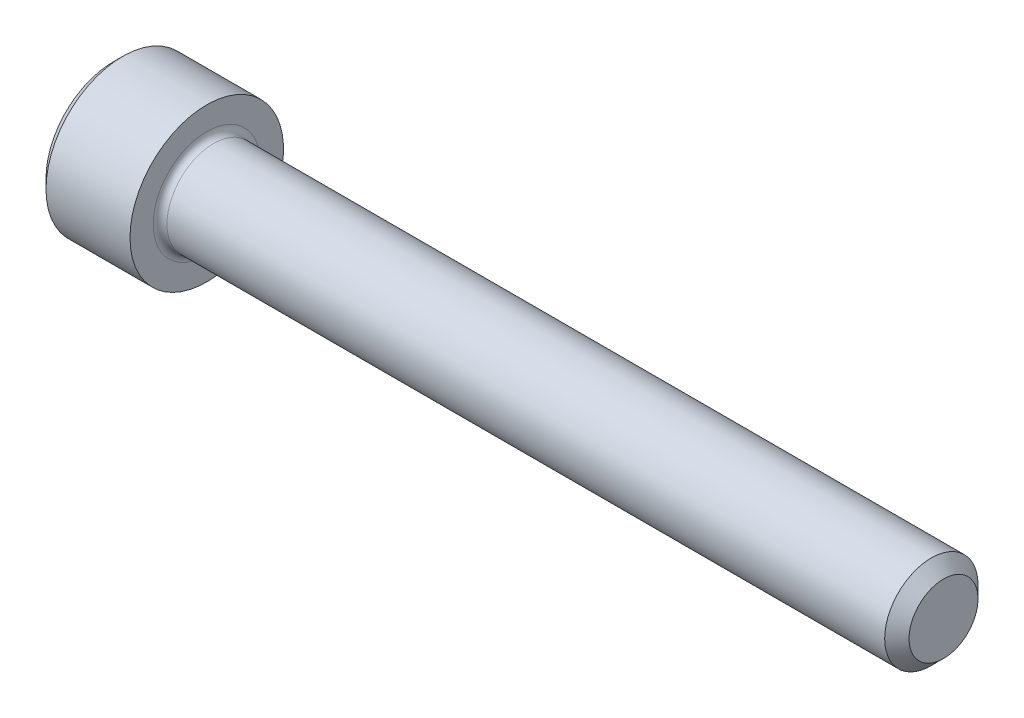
ISO-10303-21;
HEADER;
FILE_DESCRIPTION(('STEP AP214'),'2;1');
FILE_NAME('part.step','',(''),(''),'','','');
FILE_SCHEMA(('AUTOMOTIVE_DESIGN { 1 0 10303 214 1 1 1 1 }'));
ENDSEC;
DATA;
#1=APPLICATION_CONTEXT('core data for automotive mechanical design processes');
#2=APPLICATION_PROTOCOL_DEFINITION('international standard','automotive_design',2000,#1);
#3=PRODUCT_CONTEXT('',#1,'mechanical');
#4=PRODUCT('Part','Part','',(#3));
#5=PRODUCT_RELATED_PRODUCT_CATEGORY('part','',(#4));
#6=PRODUCT_DEFINITION_FORMATION('','',#4);
#7=PRODUCT_DEFINITION_CONTEXT('part definition',#1,'design');
#8=PRODUCT_DEFINITION('design','',#6,#7);
#9=PRODUCT_DEFINITION_SHAPE('','',#8);
#10=(LENGTH_UNIT() NAMED_UNIT(*) SI_UNIT(.MILLI.,.METRE.));
#11=(NAMED_UNIT(*) PLANE_ANGLE_UNIT() SI_UNIT($,.RADIAN.));
#12=(NAMED_UNIT(*) SI_UNIT($,.STERADIAN.) SOLID_ANGLE_UNIT());
#13=UNCERTAINTY_MEASURE_WITH_UNIT(LENGTH_MEASURE(1.E-05),#10,'distance_accuracy_value','');
#14=(GEOMETRIC_REPRESENTATION_CONTEXT(3) GLOBAL_UNCERTAINTY_ASSIGNED_CONTEXT((#13)) GLOBAL_UNIT_ASSIGNED_CONTEXT((#10,
#11,#12)) REPRESENTATION_CONTEXT('',''));
#15=CARTESIAN_POINT('',(0.,0.,0.));
#16=DIRECTION('',(0.,0.,1.));
#17=DIRECTION('',(1.,0.,0.));
#18=AXIS2_PLACEMENT_3D('',#15,#16,#17);
#19=CARTESIAN_POINT('',(0.,0.,0.));
#20=DIRECTION('',(-1.,0.,0.));
#21=DIRECTION('',(0.,0.,0.999999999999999));
#22=AXIS2_PLACEMENT_3D('',#19,#20,#21);
#23=PLANE('',#22);
#24=DIRECTION('',(0.,-0.499999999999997,0.866025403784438));
#25=VECTOR('',#24,1.);
#26=CARTESIAN_POINT('',(0.,2.2920921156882,0.));
#27=LINE('',#26,#25);
#28=CARTESIAN_POINT('',(0.,2.2920921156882,0.));
#29=VERTEX_POINT('',#28);
#30=CARTESIAN_POINT('',(-6.10622663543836E-13,1.14604605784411,1.98500999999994));
#31=VERTEX_POINT('',#30);
#32=EDGE_CURVE('E261',#29,#31,#27,.T.);
#33=ORIENTED_EDGE('',*,*,#32,.T.);
#34=DIRECTION('',(0.,0.999999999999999,0.));
#35=VECTOR('',#34,1.);
#36=CARTESIAN_POINT('',(-6.10622663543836E-13,-1.14604605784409,1.98500999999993));
#37=LINE('',#36,#35);
#38=CARTESIAN_POINT('',(-6.10622663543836E-13,-1.14604605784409,1.98500999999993));
#39=VERTEX_POINT('',#38);
#40=EDGE_CURVE('E132',#39,#31,#37,.T.);
#41=ORIENTED_EDGE('',*,*,#40,.F.);
#42=DIRECTION('',(0.,-0.5,-0.866025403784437));
#43=VECTOR('',#42,1.);
#44=CARTESIAN_POINT('',(-6.10622663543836E-13,-1.14604605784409,1.98500999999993));
#45=LINE('',#44,#43);
#46=CARTESIAN_POINT('',(0.,-2.29209211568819,0.));
#47=VERTEX_POINT('',#46);
#48=EDGE_CURVE('E264',#39,#47,#45,.T.);
#49=ORIENTED_EDGE('',*,*,#48,.T.);
#50=DIRECTION('',(0.,0.499999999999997,-0.86602540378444));
#51=VECTOR('',#50,1.);
#52=CARTESIAN_POINT('',(0.,-2.29209211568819,0.));
#53=LINE('',#52,#51);
#54=CARTESIAN_POINT('',(1.38777878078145E-13,-1.14604605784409,-1.98501000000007));
#55=VERTEX_POINT('',#54);
#56=EDGE_CURVE('E267',#47,#55,#53,.T.);
#57=ORIENTED_EDGE('',*,*,#56,.T.);
#58=DIRECTION('',(0.,-0.999999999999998,0.));
#59=VECTOR('',#58,1.);
#60=CARTESIAN_POINT('',(2.4980018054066E-13,1.1460460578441,-1.98501000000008));
#61=LINE('',#60,#59);
#62=CARTESIAN_POINT('',(2.4980018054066E-13,1.1460460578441,-1.98501000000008));
#63=VERTEX_POINT('',#62);
#64=EDGE_CURVE('E270',#63,#55,#61,.T.);
#65=ORIENTED_EDGE('',*,*,#64,.F.);
#66=DIRECTION('',(0.,-0.5,-0.866025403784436));
#67=VECTOR('',#66,1.);
#68=CARTESIAN_POINT('',(0.,2.2920921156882,0.));
#69=LINE('',#68,#67);
#70=EDGE_CURVE('E127',#29,#63,#69,.T.);
#71=ORIENTED_EDGE('',*,*,#70,.F.);
#72=EDGE_LOOP('',(#33,#41,#49,#57,#65,#71));
#73=FACE_BOUND('',#72,.T.);
#74=CARTESIAN_POINT('',(0.,0.,0.));
#75=DIRECTION('',(-1.,0.,0.));
#76=DIRECTION('',(0.,0.,0.999999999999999));
#77=AXIS2_PLACEMENT_3D('',#74,#75,#76);
#78=CIRCLE('',#77,3.48615);
#79=CARTESIAN_POINT('',(0.,0.,3.48615));
#80=VERTEX_POINT('',#79);
#81=EDGE_CURVE('E156',#80,#80,#78,.T.);
#82=ORIENTED_EDGE('',*,*,#81,.T.);
#83=EDGE_LOOP('',(#82));
#84=FACE_BOUND('',#83,.T.);
#85=ADVANCED_FACE('F36',(#73,#84),#23,.T.);
#86=CARTESIAN_POINT('',(0.,0.,0.));
#87=DIRECTION('',(1.,0.,0.));
#88=DIRECTION('',(0.,0.,-0.999999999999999));
#89=AXIS2_PLACEMENT_3D('',#86,#87,#88);
#90=CONICAL_SURFACE('',#89,3.48615,0.785398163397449);
#91=CARTESIAN_POINT('',(0.4826,0.,0.));
#92=DIRECTION('',(-1.,0.,0.));
#93=DIRECTION('',(0.,0.,0.999999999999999));
#94=AXIS2_PLACEMENT_3D('',#91,#92,#93);
#95=CIRCLE('',#94,3.96875);
#96=CARTESIAN_POINT('',(0.482599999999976,0.,3.96875));
#97=VERTEX_POINT('',#96);
#98=EDGE_CURVE('E153',#97,#97,#95,.T.);
#99=ORIENTED_EDGE('',*,*,#98,.T.);
#100=EDGE_LOOP('',(#99));
#101=FACE_BOUND('',#100,.T.);
#102=ORIENTED_EDGE('',*,*,#81,.F.);
#103=EDGE_LOOP('',(#102));
#104=FACE_BOUND('',#103,.T.);
#105=ADVANCED_FACE('F177',(#101,#104),#90,.T.);
#106=CARTESIAN_POINT('',(-31.75,0.,1.80411241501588E-13));
#107=DIRECTION('',(-1.,0.,0.));
#108=DIRECTION('',(0.,0.,0.999999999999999));
#109=AXIS2_PLACEMENT_3D('',#106,#107,#108);
#110=CYLINDRICAL_SURFACE('',#109,3.96875);
#111=CARTESIAN_POINT('',(4.826,0.,-1.07552855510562E-13));
#112=DIRECTION('',(-1.,0.,0.));
#113=DIRECTION('',(0.,0.,0.999999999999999));
#114=AXIS2_PLACEMENT_3D('',#111,#112,#113);
#115=CIRCLE('',#114,3.96875);
#116=CARTESIAN_POINT('',(4.82599999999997,0.,3.96874999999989));
#117=VERTEX_POINT('',#116);
#118=EDGE_CURVE('E150',#117,#117,#115,.T.);
#119=ORIENTED_EDGE('',*,*,#118,.T.);
#120=EDGE_LOOP('',(#119));
#121=FACE_BOUND('',#120,.T.);
#122=ORIENTED_EDGE('',*,*,#98,.F.);
#123=EDGE_LOOP('',(#122));
#124=FACE_BOUND('',#123,.T.);
#125=ADVANCED_FACE('F182',(#121,#124),#110,.T.);
#126=CARTESIAN_POINT('',(4.826,3.96874999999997,0.));
#127=DIRECTION('',(1.,0.,0.));
#128=DIRECTION('',(0.,0.,-0.999999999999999));
#129=AXIS2_PLACEMENT_3D('',#126,#127,#128);
#130=PLANE('',#129);
#131=CARTESIAN_POINT('',(4.826,0.,-1.07552855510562E-13));
#132=DIRECTION('',(1.,0.,0.));
#133=DIRECTION('',(0.,0.,-0.999999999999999));
#134=AXIS2_PLACEMENT_3D('',#131,#132,#133);
#135=CIRCLE('',#134,2.76859999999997);
#136=CARTESIAN_POINT('',(4.82600000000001,0.,-2.76860000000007));
#137=VERTEX_POINT('',#136);
#138=EDGE_CURVE('E44',#137,#137,#135,.F.);
#139=ORIENTED_EDGE('',*,*,#138,.T.);
#140=EDGE_LOOP('',(#139));
#141=FACE_BOUND('',#140,.T.);
#142=ORIENTED_EDGE('',*,*,#118,.F.);
#143=EDGE_LOOP('',(#142));
#144=FACE_BOUND('',#143,.T.);
#145=ADVANCED_FACE('F161',(#141,#144),#130,.T.);
#146=CARTESIAN_POINT('',(-31.75,0.,1.80411241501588E-13));
#147=DIRECTION('',(-1.,0.,0.));
#148=DIRECTION('',(0.,0.,0.999999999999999));
#149=AXIS2_PLACEMENT_3D('',#146,#147,#148);
#150=CYLINDRICAL_SURFACE('',#149,2.41299999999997);
#151=CARTESIAN_POINT('',(5.18160000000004,0.,-1.07552855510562E-13));
#152=DIRECTION('',(1.,0.,0.));
#153=DIRECTION('',(0.,0.,-0.999999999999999));
#154=AXIS2_PLACEMENT_3D('',#151,#152,#153);
#155=CIRCLE('',#154,2.41299999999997);
#156=CARTESIAN_POINT('',(5.18160000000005,0.,-2.41300000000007));
#157=VERTEX_POINT('',#156);
#158=EDGE_CURVE('E11',#157,#157,#155,.T.);
#159=ORIENTED_EDGE('',*,*,#158,.T.);
#160=EDGE_LOOP('',(#159));
#161=FACE_BOUND('',#160,.T.);
#162=CARTESIAN_POINT('',(42.2960799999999,0.,-3.12250225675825E-13));
#163=DIRECTION('',(-1.,0.,0.));
#164=DIRECTION('',(0.,0.,0.999999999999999));
#165=AXIS2_PLACEMENT_3D('',#162,#163,#164);
#166=CIRCLE('',#165,2.41299999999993);
#167=CARTESIAN_POINT('',(42.2960799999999,0.,2.41299999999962));
#168=VERTEX_POINT('',#167);
#169=EDGE_CURVE('E147',#168,#168,#166,.T.);
#170=ORIENTED_EDGE('',*,*,#169,.T.);
#171=EDGE_LOOP('',(#170));
#172=FACE_BOUND('',#171,.T.);
#173=ADVANCED_FACE('F192',(#161,#172),#150,.T.);
#174=CARTESIAN_POINT('',(42.926,0.,-4.16333634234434E-13));
#175=DIRECTION('',(-1.,0.,0.));
#176=DIRECTION('',(0.,0.,0.999999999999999));
#177=AXIS2_PLACEMENT_3D('',#174,#175,#176);
#178=CONICAL_SURFACE('',#177,1.78308,0.785398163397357);
#179=ORIENTED_EDGE('',*,*,#169,.F.);
#180=EDGE_LOOP('',(#179));
#181=FACE_BOUND('',#180,.T.);
#182=CARTESIAN_POINT('',(42.926,0.,-4.16333634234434E-13));
#183=DIRECTION('',(-1.,0.,0.));
#184=DIRECTION('',(0.,0.,0.999999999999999));
#185=AXIS2_PLACEMENT_3D('',#182,#183,#184);
#186=CIRCLE('',#185,1.78308);
#187=CARTESIAN_POINT('',(42.926,0.,1.78307999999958));
#188=VERTEX_POINT('',#187);
#189=EDGE_CURVE('E143',#188,#188,#186,.T.);
#190=ORIENTED_EDGE('',*,*,#189,.T.);
#191=EDGE_LOOP('',(#190));
#192=FACE_BOUND('',#191,.T.);
#193=ADVANCED_FACE('F172',(#181,#192),#178,.T.);
#194=CARTESIAN_POINT('',(42.926,1.78308,-4.09394740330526E-13));
#195=DIRECTION('',(1.,0.,0.));
#196=DIRECTION('',(0.,0.,-0.999999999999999));
#197=AXIS2_PLACEMENT_3D('',#194,#195,#196);
#198=PLANE('',#197);
#199=ORIENTED_EDGE('',*,*,#189,.F.);
#200=EDGE_LOOP('',(#199));
#201=FACE_BOUND('',#200,.T.);
#202=ADVANCED_FACE('F165',(#201),#198,.T.);
#203=CARTESIAN_POINT('',(5.18160000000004,0.,-1.07552855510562E-13));
#204=DIRECTION('',(1.,0.,0.));
#205=DIRECTION('',(0.,0.,-0.999999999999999));
#206=AXIS2_PLACEMENT_3D('',#203,#204,#205);
#207=TOROIDAL_SURFACE('',#206,2.76859999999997,0.3556);
#208=ORIENTED_EDGE('',*,*,#158,.F.);
#209=EDGE_LOOP('',(#208));
#210=FACE_BOUND('',#209,.T.);
#211=ORIENTED_EDGE('',*,*,#138,.F.);
#212=EDGE_LOOP('',(#211));
#213=FACE_BOUND('',#212,.T.);
#214=ADVANCED_FACE('F38',(#210,#213),#207,.F.);
#215=CARTESIAN_POINT('',(2.28600000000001,2.2920921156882,-1.94289029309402E-13));
#216=DIRECTION('',(0.,-0.866025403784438,-0.499999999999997));
#217=DIRECTION('',(0.,0.499999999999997,-0.866025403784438));
#218=AXIS2_PLACEMENT_3D('',#215,#216,#217);
#219=PLANE('',#218);
#220=ORIENTED_EDGE('',*,*,#32,.F.);
#221=DIRECTION('',(-1.,0.,0.));
#222=VECTOR('',#221,1.);
#223=CARTESIAN_POINT('',(2.28600000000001,2.2920921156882,-1.94289029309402E-13));
#224=LINE('',#223,#222);
#225=CARTESIAN_POINT('',(2.28600000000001,2.2920921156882,-1.94289029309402E-13));
#226=VERTEX_POINT('',#225);
#227=EDGE_CURVE('E251',#226,#29,#224,.T.);
#228=ORIENTED_EDGE('',*,*,#227,.F.);
#229=DIRECTION('',(0.,-0.499999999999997,0.866025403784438));
#230=VECTOR('',#229,1.);
#231=CARTESIAN_POINT('',(2.28600000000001,2.2920921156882,-1.94289029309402E-13));
#232=LINE('',#231,#230);
#233=CARTESIAN_POINT('',(2.2859999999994,1.71906908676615,0.992504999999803));
#234=VERTEX_POINT('',#233);
#235=EDGE_CURVE('E119',#226,#234,#232,.T.);
#236=ORIENTED_EDGE('',*,*,#235,.T.);
#237=CARTESIAN_POINT('',(2.28599999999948,1.14604605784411,1.98500999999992));
#238=VERTEX_POINT('',#237);
#239=EDGE_CURVE('E110',#234,#238,#232,.T.);
#240=ORIENTED_EDGE('',*,*,#239,.T.);
#241=DIRECTION('',(-1.,0.,0.));
#242=VECTOR('',#241,1.);
#243=CARTESIAN_POINT('',(2.28599999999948,1.14604605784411,1.98500999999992));
#244=LINE('',#243,#242);
#245=EDGE_CURVE('E124',#238,#31,#244,.T.);
#246=ORIENTED_EDGE('',*,*,#245,.T.);
#247=EDGE_LOOP('',(#220,#228,#236,#240,#246));
#248=FACE_BOUND('',#247,.T.);
#249=ADVANCED_FACE('F123',(#248),#219,.T.);
#250=CARTESIAN_POINT('',(2.28599999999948,-1.14604605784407,1.98500999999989));
#251=DIRECTION('',(0.,0.,0.999999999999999));
#252=DIRECTION('',(0.,-0.999999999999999,0.));
#253=AXIS2_PLACEMENT_3D('',#250,#251,#252);
#254=PLANE('',#253);
#255=ORIENTED_EDGE('',*,*,#40,.T.);
#256=ORIENTED_EDGE('',*,*,#245,.F.);
#257=DIRECTION('',(0.,0.999999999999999,0.));
#258=VECTOR('',#257,1.);
#259=CARTESIAN_POINT('',(2.28599999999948,-1.14604605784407,1.98500999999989));
#260=LINE('',#259,#258);
#261=CARTESIAN_POINT('',(2.28599999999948,0.,1.98500999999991));
#262=VERTEX_POINT('',#261);
#263=EDGE_CURVE('E107',#262,#238,#260,.T.);
#264=ORIENTED_EDGE('',*,*,#263,.F.);
#265=CARTESIAN_POINT('',(2.28599999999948,-1.14604605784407,1.98500999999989));
#266=VERTEX_POINT('',#265);
#267=EDGE_CURVE('E118',#266,#262,#260,.T.);
#268=ORIENTED_EDGE('',*,*,#267,.F.);
#269=DIRECTION('',(-1.,0.,0.));
#270=VECTOR('',#269,1.);
#271=CARTESIAN_POINT('',(2.28599999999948,-1.14604605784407,1.98500999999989));
#272=LINE('',#271,#270);
#273=EDGE_CURVE('E134',#266,#39,#272,.T.);
#274=ORIENTED_EDGE('',*,*,#273,.T.);
#275=EDGE_LOOP('',(#255,#256,#264,#268,#274));
#276=FACE_BOUND('',#275,.T.);
#277=ADVANCED_FACE('F129',(#276),#254,.F.);
#278=CARTESIAN_POINT('',(2.28599999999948,-1.14604605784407,1.98500999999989));
#279=DIRECTION('',(0.,0.866025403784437,-0.5));
#280=DIRECTION('',(0.,0.5,0.866025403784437));
#281=AXIS2_PLACEMENT_3D('',#278,#279,#280);
#282=PLANE('',#281);
#283=ORIENTED_EDGE('',*,*,#48,.F.);
#284=ORIENTED_EDGE('',*,*,#273,.F.);
#285=DIRECTION('',(0.,-0.5,-0.866025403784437));
#286=VECTOR('',#285,1.);
#287=CARTESIAN_POINT('',(2.28599999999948,-1.14604605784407,1.98500999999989));
#288=LINE('',#287,#286);
#289=CARTESIAN_POINT('',(2.2859999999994,-1.71906908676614,0.992504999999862));
#290=VERTEX_POINT('',#289);
#291=EDGE_CURVE('E290',#266,#290,#288,.T.);
#292=ORIENTED_EDGE('',*,*,#291,.T.);
#293=CARTESIAN_POINT('',(2.28600000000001,-2.29209211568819,0.));
#294=VERTEX_POINT('',#293);
#295=EDGE_CURVE('E279',#290,#294,#288,.T.);
#296=ORIENTED_EDGE('',*,*,#295,.T.);
#297=DIRECTION('',(-1.,0.,0.));
#298=VECTOR('',#297,1.);
#299=CARTESIAN_POINT('',(2.28600000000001,-2.29209211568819,0.));
#300=LINE('',#299,#298);
#301=EDGE_CURVE('E139',#294,#47,#300,.T.);
#302=ORIENTED_EDGE('',*,*,#301,.T.);
#303=EDGE_LOOP('',(#283,#284,#292,#296,#302));
#304=FACE_BOUND('',#303,.T.);
#305=ADVANCED_FACE('F205',(#304),#282,.T.);
#306=CARTESIAN_POINT('',(2.28600000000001,-2.29209211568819,0.));
#307=DIRECTION('',(0.,0.86602540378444,0.499999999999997));
#308=DIRECTION('',(0.,-0.499999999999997,0.86602540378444));
#309=AXIS2_PLACEMENT_3D('',#306,#307,#308);
#310=PLANE('',#309);
#311=ORIENTED_EDGE('',*,*,#56,.F.);
#312=ORIENTED_EDGE('',*,*,#301,.F.);
#313=DIRECTION('',(0.,0.499999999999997,-0.86602540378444));
#314=VECTOR('',#313,1.);
#315=CARTESIAN_POINT('',(2.28600000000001,-2.29209211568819,0.));
#316=LINE('',#315,#314);
#317=CARTESIAN_POINT('',(2.28600000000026,-1.71906908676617,-0.992505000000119));
#318=VERTEX_POINT('',#317);
#319=EDGE_CURVE('E257',#294,#318,#316,.T.);
#320=ORIENTED_EDGE('',*,*,#319,.T.);
#321=CARTESIAN_POINT('',(2.28600000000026,-1.1460460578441,-1.98501000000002));
#322=VERTEX_POINT('',#321);
#323=EDGE_CURVE('E289',#318,#322,#316,.T.);
#324=ORIENTED_EDGE('',*,*,#323,.T.);
#325=DIRECTION('',(-1.,0.,0.));
#326=VECTOR('',#325,1.);
#327=CARTESIAN_POINT('',(2.28600000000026,-1.1460460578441,-1.98501000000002));
#328=LINE('',#327,#326);
#329=EDGE_CURVE('E250',#322,#55,#328,.T.);
#330=ORIENTED_EDGE('',*,*,#329,.T.);
#331=EDGE_LOOP('',(#311,#312,#320,#324,#330));
#332=FACE_BOUND('',#331,.T.);
#333=ADVANCED_FACE('F208',(#332),#310,.T.);
#334=CARTESIAN_POINT('',(2.28600000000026,1.1460460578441,-1.98501000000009));
#335=DIRECTION('',(0.,0.,-0.999999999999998));
#336=DIRECTION('',(0.,0.999999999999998,0.));
#337=AXIS2_PLACEMENT_3D('',#334,#335,#336);
#338=PLANE('',#337);
#339=ORIENTED_EDGE('',*,*,#64,.T.);
#340=ORIENTED_EDGE('',*,*,#329,.F.);
#341=DIRECTION('',(0.,-0.999999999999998,0.));
#342=VECTOR('',#341,1.);
#343=CARTESIAN_POINT('',(2.28600000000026,1.1460460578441,-1.98501000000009));
#344=LINE('',#343,#342);
#345=CARTESIAN_POINT('',(2.28600000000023,0.,-1.98501000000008));
#346=VERTEX_POINT('',#345);
#347=EDGE_CURVE('E254',#346,#322,#344,.T.);
#348=ORIENTED_EDGE('',*,*,#347,.F.);
#349=CARTESIAN_POINT('',(2.28600000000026,1.1460460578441,-1.98501000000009));
#350=VERTEX_POINT('',#349);
#351=EDGE_CURVE('E51',#350,#346,#344,.T.);
#352=ORIENTED_EDGE('',*,*,#351,.F.);
#353=DIRECTION('',(-1.,0.,0.));
#354=VECTOR('',#353,1.);
#355=CARTESIAN_POINT('',(2.28600000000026,1.1460460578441,-1.98501000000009));
#356=LINE('',#355,#354);
#357=EDGE_CURVE('E247',#350,#63,#356,.T.);
#358=ORIENTED_EDGE('',*,*,#357,.T.);
#359=EDGE_LOOP('',(#339,#340,#348,#352,#358));
#360=FACE_BOUND('',#359,.T.);
#361=ADVANCED_FACE('F212',(#360),#338,.F.);
#362=CARTESIAN_POINT('',(2.28600000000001,2.2920921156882,-1.94289029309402E-13));
#363=DIRECTION('',(0.,0.866025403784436,-0.5));
#364=DIRECTION('',(0.,0.5,0.866025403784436));
#365=AXIS2_PLACEMENT_3D('',#362,#363,#364);
#366=PLANE('',#365);
#367=ORIENTED_EDGE('',*,*,#70,.T.);
#368=ORIENTED_EDGE('',*,*,#357,.F.);
#369=DIRECTION('',(0.,-0.5,-0.866025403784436));
#370=VECTOR('',#369,1.);
#371=CARTESIAN_POINT('',(2.28600000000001,2.2920921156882,-1.94289029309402E-13));
#372=LINE('',#371,#370);
#373=CARTESIAN_POINT('',(2.28600000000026,1.71906908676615,-0.992505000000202));
#374=VERTEX_POINT('',#373);
#375=EDGE_CURVE('E237',#374,#350,#372,.T.);
#376=ORIENTED_EDGE('',*,*,#375,.F.);
#377=EDGE_CURVE('E243',#226,#374,#372,.T.);
#378=ORIENTED_EDGE('',*,*,#377,.F.);
#379=ORIENTED_EDGE('',*,*,#227,.T.);
#380=EDGE_LOOP('',(#367,#368,#376,#378,#379));
#381=FACE_BOUND('',#380,.T.);
#382=ADVANCED_FACE('F216',(#381),#366,.F.);
#383=CARTESIAN_POINT('',(2.28600000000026,3.43813817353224,-1.98501000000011));
#384=DIRECTION('',(1.,0.,0.));
#385=DIRECTION('',(0.,0.,-0.999999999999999));
#386=AXIS2_PLACEMENT_3D('',#383,#384,#385);
#387=PLANE('',#386);
#388=ORIENTED_EDGE('',*,*,#347,.T.);
#389=ORIENTED_EDGE('',*,*,#323,.F.);
#390=CARTESIAN_POINT('',(2.28600000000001,0.,-1.90819582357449E-13));
#391=DIRECTION('',(-1.,0.,0.));
#392=DIRECTION('',(0.,0.,0.999999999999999));
#393=AXIS2_PLACEMENT_3D('',#390,#391,#392);
#394=CIRCLE('',#393,1.98501);
#395=EDGE_CURVE('E285',#346,#318,#394,.T.);
#396=ORIENTED_EDGE('',*,*,#395,.F.);
#397=EDGE_LOOP('',(#388,#389,#396));
#398=FACE_BOUND('',#397,.T.);
#399=ADVANCED_FACE('F220',(#398),#387,.F.);
#400=ORIENTED_EDGE('',*,*,#319,.F.);
#401=ORIENTED_EDGE('',*,*,#295,.F.);
#402=EDGE_CURVE('E137',#318,#290,#394,.T.);
#403=ORIENTED_EDGE('',*,*,#402,.F.);
#404=EDGE_LOOP('',(#400,#401,#403));
#405=FACE_BOUND('',#404,.T.);
#406=ADVANCED_FACE('F223',(#405),#387,.F.);
#407=ORIENTED_EDGE('',*,*,#291,.F.);
#408=ORIENTED_EDGE('',*,*,#267,.T.);
#409=EDGE_CURVE('E133',#290,#262,#394,.T.);
#410=ORIENTED_EDGE('',*,*,#409,.F.);
#411=EDGE_LOOP('',(#407,#408,#410));
#412=FACE_BOUND('',#411,.T.);
#413=ADVANCED_FACE('F228',(#412),#387,.F.);
#414=ORIENTED_EDGE('',*,*,#263,.T.);
#415=ORIENTED_EDGE('',*,*,#239,.F.);
#416=EDGE_CURVE('E113',#262,#234,#394,.T.);
#417=ORIENTED_EDGE('',*,*,#416,.F.);
#418=EDGE_LOOP('',(#414,#415,#417));
#419=FACE_BOUND('',#418,.T.);
#420=ADVANCED_FACE('F109',(#419),#387,.F.);
#421=ORIENTED_EDGE('',*,*,#235,.F.);
#422=ORIENTED_EDGE('',*,*,#377,.T.);
#423=EDGE_CURVE('E144',#234,#374,#394,.T.);
#424=ORIENTED_EDGE('',*,*,#423,.F.);
#425=EDGE_LOOP('',(#421,#422,#424));
#426=FACE_BOUND('',#425,.T.);
#427=ADVANCED_FACE('F231',(#426),#387,.F.);
#428=ORIENTED_EDGE('',*,*,#375,.T.);
#429=ORIENTED_EDGE('',*,*,#351,.T.);
#430=EDGE_CURVE('E240',#374,#346,#394,.T.);
#431=ORIENTED_EDGE('',*,*,#430,.F.);
#432=EDGE_LOOP('',(#428,#429,#431));
#433=FACE_BOUND('',#432,.T.);
#434=ADVANCED_FACE('F201',(#433),#387,.F.);
#435=CARTESIAN_POINT('',(2.28600000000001,0.,-1.90819582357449E-13));
#436=DIRECTION('',(-1.,0.,0.));
#437=DIRECTION('',(0.,0.,0.999999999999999));
#438=AXIS2_PLACEMENT_3D('',#435,#436,#437);
#439=CONICAL_SURFACE('',#438,1.98501,1.04719755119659);
#440=CARTESIAN_POINT('',(3.43204605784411,0.,0.));
#441=VERTEX_POINT('',#440);
#442=VERTEX_LOOP('',#441);
#443=FACE_BOUND('',#442,.T.);
#444=ORIENTED_EDGE('',*,*,#416,.T.);
#445=ORIENTED_EDGE('',*,*,#423,.T.);
#446=ORIENTED_EDGE('',*,*,#430,.T.);
#447=ORIENTED_EDGE('',*,*,#395,.T.);
#448=ORIENTED_EDGE('',*,*,#402,.T.);
#449=ORIENTED_EDGE('',*,*,#409,.T.);
#450=EDGE_LOOP('',(#444,#445,#446,#447,#448,#449));
#451=FACE_BOUND('',#450,.T.);
#452=ADVANCED_FACE('F199',(#443,#451),#439,.F.);
#453=CLOSED_SHELL('',(#85,#105,#125,#145,#173,#193,#202,#214,#249,#277,#305,#333,#361,#382,#399,
#406,#413,#420,#427,#434,#452));
#454=MANIFOLD_SOLID_BREP('B2',#453);
#455=ADVANCED_BREP_SHAPE_REPRESENTATION('',(#18,#454),#14);
#456=SHAPE_DEFINITION_REPRESENTATION(#9,#455);
ENDSEC;
END-ISO-10303-21;
